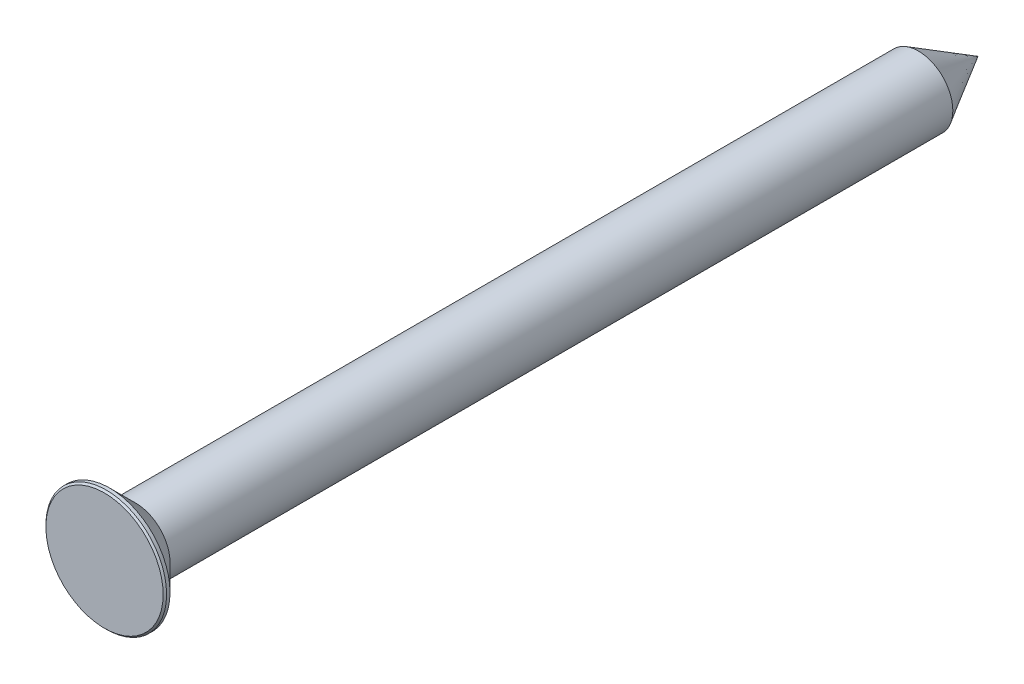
ISO-10303-21;
HEADER;
FILE_DESCRIPTION(('STEP AP214'),'2;1');
FILE_NAME('part.step','',(''),(''),'','','');
FILE_SCHEMA(('AUTOMOTIVE_DESIGN { 1 0 10303 214 1 1 1 1 }'));
ENDSEC;
DATA;
#1=APPLICATION_CONTEXT('core data for automotive mechanical design processes');
#2=APPLICATION_PROTOCOL_DEFINITION('international standard','automotive_design',2000,#1);
#3=PRODUCT_CONTEXT('',#1,'mechanical');
#4=PRODUCT('Part','Part','',(#3));
#5=PRODUCT_RELATED_PRODUCT_CATEGORY('part','',(#4));
#6=PRODUCT_DEFINITION_FORMATION('','',#4);
#7=PRODUCT_DEFINITION_CONTEXT('part definition',#1,'design');
#8=PRODUCT_DEFINITION('design','',#6,#7);
#9=PRODUCT_DEFINITION_SHAPE('','',#8);
#10=(LENGTH_UNIT() NAMED_UNIT(*) SI_UNIT(.MILLI.,.METRE.));
#11=(NAMED_UNIT(*) PLANE_ANGLE_UNIT() SI_UNIT($,.RADIAN.));
#12=(NAMED_UNIT(*) SI_UNIT($,.STERADIAN.) SOLID_ANGLE_UNIT());
#13=UNCERTAINTY_MEASURE_WITH_UNIT(LENGTH_MEASURE(1.E-05),#10,'distance_accuracy_value','');
#14=(GEOMETRIC_REPRESENTATION_CONTEXT(3) GLOBAL_UNCERTAINTY_ASSIGNED_CONTEXT((#13)) GLOBAL_UNIT_ASSIGNED_CONTEXT((#10,
#11,#12)) REPRESENTATION_CONTEXT('',''));
#15=CARTESIAN_POINT('',(0.,0.,0.));
#16=DIRECTION('',(0.,0.,1.));
#17=DIRECTION('',(1.,0.,0.));
#18=AXIS2_PLACEMENT_3D('',#15,#16,#17);
#19=CARTESIAN_POINT('',(0.,3.41,0.));
#20=DIRECTION('',(0.,0.,-1.));
#21=DIRECTION('',(-1.,0.,0.));
#22=AXIS2_PLACEMENT_3D('',#19,#20,#21);
#23=PLANE('',#22);
#24=CARTESIAN_POINT('',(0.,0.,0.));
#25=DIRECTION('',(0.,0.,1.));
#26=DIRECTION('',(1.,0.,0.));
#27=AXIS2_PLACEMENT_3D('',#24,#25,#26);
#28=CIRCLE('',#27,3.41);
#29=CARTESIAN_POINT('',(3.41,0.,0.));
#30=VERTEX_POINT('',#29);
#31=EDGE_CURVE('E69',#30,#30,#28,.T.);
#32=ORIENTED_EDGE('',*,*,#31,.T.);
#33=EDGE_LOOP('',(#32));
#34=FACE_BOUND('',#33,.T.);
#35=ADVANCED_FACE('F31',(#34),#23,.F.);
#36=CARTESIAN_POINT('',(0.,0.,-50.8));
#37=DIRECTION('',(0.,0.,1.));
#38=DIRECTION('',(1.,0.,0.));
#39=AXIS2_PLACEMENT_3D('',#36,#37,#38);
#40=CONICAL_SURFACE('',#39,0.,0.523598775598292);
#41=CARTESIAN_POINT('',(0.,0.,-47.3358983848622));
#42=DIRECTION('',(0.,0.,1.));
#43=DIRECTION('',(1.,0.,0.));
#44=AXIS2_PLACEMENT_3D('',#41,#42,#43);
#45=CIRCLE('',#44,2.);
#46=CARTESIAN_POINT('',(2.,0.,-47.3358983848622));
#47=VERTEX_POINT('',#46);
#48=EDGE_CURVE('E11',#47,#47,#45,.T.);
#49=ORIENTED_EDGE('',*,*,#48,.F.);
#50=EDGE_LOOP('',(#49));
#51=FACE_BOUND('',#50,.T.);
#52=CARTESIAN_POINT('',(0.,0.,-50.8));
#53=VERTEX_POINT('',#52);
#54=VERTEX_LOOP('',#53);
#55=FACE_BOUND('',#54,.T.);
#56=ADVANCED_FACE('F40',(#51,#55),#40,.T.);
#57=CARTESIAN_POINT('',(0.,0.,0.));
#58=DIRECTION('',(0.,0.,1.));
#59=DIRECTION('',(1.,0.,0.));
#60=AXIS2_PLACEMENT_3D('',#57,#58,#59);
#61=CYLINDRICAL_SURFACE('',#60,2.);
#62=CARTESIAN_POINT('',(0.,0.,-1.81000000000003));
#63=DIRECTION('',(0.,0.,1.));
#64=DIRECTION('',(1.,0.,0.));
#65=AXIS2_PLACEMENT_3D('',#62,#63,#64);
#66=CIRCLE('',#65,1.99999999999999);
#67=CARTESIAN_POINT('',(1.99999999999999,0.,-1.81000000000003));
#68=VERTEX_POINT('',#67);
#69=EDGE_CURVE('E37',#68,#68,#66,.T.);
#70=ORIENTED_EDGE('',*,*,#69,.F.);
#71=EDGE_LOOP('',(#70));
#72=FACE_BOUND('',#71,.T.);
#73=ORIENTED_EDGE('',*,*,#48,.T.);
#74=EDGE_LOOP('',(#73));
#75=FACE_BOUND('',#74,.T.);
#76=ADVANCED_FACE('F42',(#72,#75),#61,.T.);
#77=CARTESIAN_POINT('',(0.,0.,-1.81000000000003));
#78=DIRECTION('',(0.,0.,1.));
#79=DIRECTION('',(1.,0.,0.));
#80=AXIS2_PLACEMENT_3D('',#77,#78,#79);
#81=CONICAL_SURFACE('',#80,1.99999999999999,0.785398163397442);
#82=CARTESIAN_POINT('',(0.,0.,-0.3));
#83=DIRECTION('',(0.,0.,1.));
#84=DIRECTION('',(1.,0.,0.));
#85=AXIS2_PLACEMENT_3D('',#82,#83,#84);
#86=CIRCLE('',#85,3.51);
#87=CARTESIAN_POINT('',(3.51,0.,-0.3));
#88=VERTEX_POINT('',#87);
#89=EDGE_CURVE('E73',#88,#88,#86,.T.);
#90=ORIENTED_EDGE('',*,*,#89,.F.);
#91=EDGE_LOOP('',(#90));
#92=FACE_BOUND('',#91,.T.);
#93=ORIENTED_EDGE('',*,*,#69,.T.);
#94=EDGE_LOOP('',(#93));
#95=FACE_BOUND('',#94,.T.);
#96=ADVANCED_FACE('F48',(#92,#95),#81,.T.);
#97=CARTESIAN_POINT('',(0.,0.,0.));
#98=DIRECTION('',(0.,0.,1.));
#99=DIRECTION('',(1.,0.,0.));
#100=AXIS2_PLACEMENT_3D('',#97,#98,#99);
#101=CYLINDRICAL_SURFACE('',#100,3.51);
#102=CARTESIAN_POINT('',(0.,0.,-0.1));
#103=DIRECTION('',(0.,0.,1.));
#104=DIRECTION('',(1.,0.,0.));
#105=AXIS2_PLACEMENT_3D('',#102,#103,#104);
#106=CIRCLE('',#105,3.51);
#107=CARTESIAN_POINT('',(3.51,0.,-0.1));
#108=VERTEX_POINT('',#107);
#109=EDGE_CURVE('E72',#108,#108,#106,.T.);
#110=ORIENTED_EDGE('',*,*,#109,.F.);
#111=EDGE_LOOP('',(#110));
#112=FACE_BOUND('',#111,.T.);
#113=ORIENTED_EDGE('',*,*,#89,.T.);
#114=EDGE_LOOP('',(#113));
#115=FACE_BOUND('',#114,.T.);
#116=ADVANCED_FACE('F56',(#112,#115),#101,.T.);
#117=CARTESIAN_POINT('',(0.,0.,-0.1));
#118=DIRECTION('',(0.,0.,-1.));
#119=DIRECTION('',(-1.,0.,0.));
#120=AXIS2_PLACEMENT_3D('',#117,#118,#119);
#121=CONICAL_SURFACE('',#120,3.51,0.785398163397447);
#122=ORIENTED_EDGE('',*,*,#31,.F.);
#123=EDGE_LOOP('',(#122));
#124=FACE_BOUND('',#123,.T.);
#125=ORIENTED_EDGE('',*,*,#109,.T.);
#126=EDGE_LOOP('',(#125));
#127=FACE_BOUND('',#126,.T.);
#128=ADVANCED_FACE('F60',(#124,#127),#121,.T.);
#129=CLOSED_SHELL('',(#35,#56,#76,#96,#116,#128));
#130=MANIFOLD_SOLID_BREP('B2',#129);
#131=ADVANCED_BREP_SHAPE_REPRESENTATION('',(#18,#130),#14);
#132=SHAPE_DEFINITION_REPRESENTATION(#9,#131);
ENDSEC;
END-ISO-10303-21;
